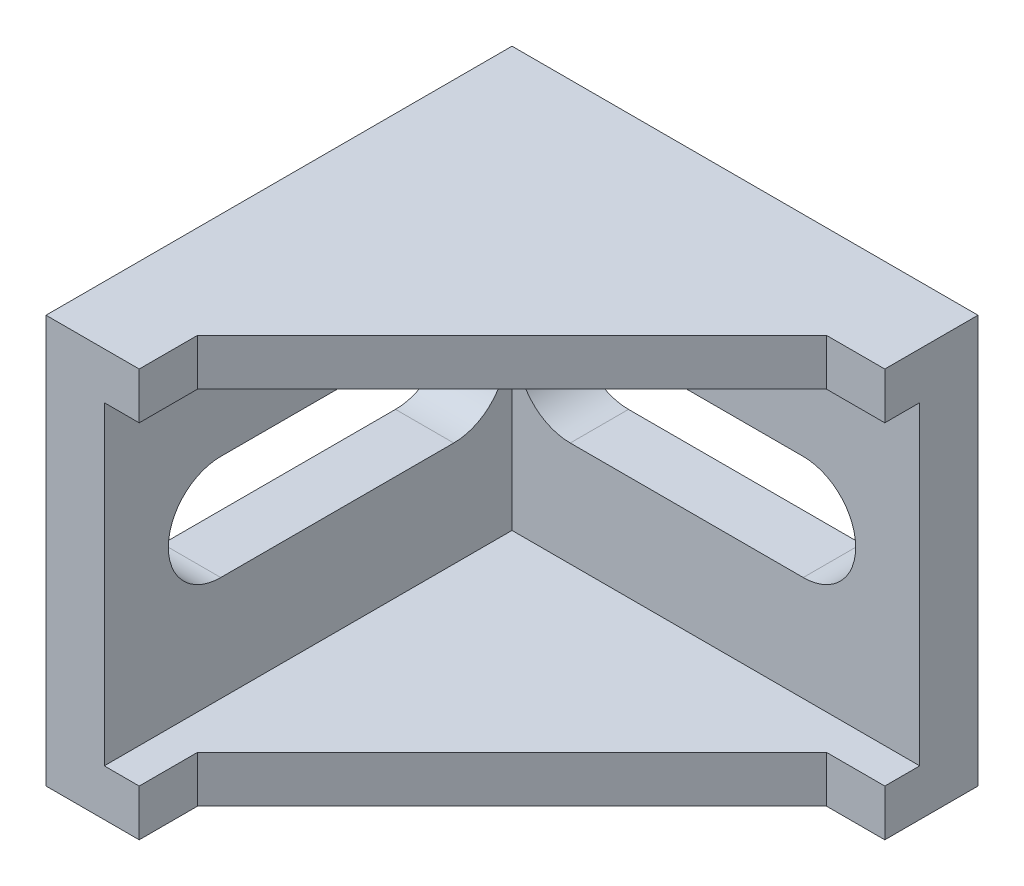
ISO-10303-21;
HEADER;
FILE_DESCRIPTION(('STEP AP214'),'2;1');
FILE_NAME('part.step','',(''),(''),'','','');
FILE_SCHEMA(('AUTOMOTIVE_DESIGN { 1 0 10303 214 1 1 1 1 }'));
ENDSEC;
DATA;
#1=APPLICATION_CONTEXT('core data for automotive mechanical design processes');
#2=APPLICATION_PROTOCOL_DEFINITION('international standard','automotive_design',2000,#1);
#3=PRODUCT_CONTEXT('',#1,'mechanical');
#4=PRODUCT('Part','Part','',(#3));
#5=PRODUCT_RELATED_PRODUCT_CATEGORY('part','',(#4));
#6=PRODUCT_DEFINITION_FORMATION('','',#4);
#7=PRODUCT_DEFINITION_CONTEXT('part definition',#1,'design');
#8=PRODUCT_DEFINITION('design','',#6,#7);
#9=PRODUCT_DEFINITION_SHAPE('','',#8);
#10=(LENGTH_UNIT() NAMED_UNIT(*) SI_UNIT(.MILLI.,.METRE.));
#11=(NAMED_UNIT(*) PLANE_ANGLE_UNIT() SI_UNIT($,.RADIAN.));
#12=(NAMED_UNIT(*) SI_UNIT($,.STERADIAN.) SOLID_ANGLE_UNIT());
#13=UNCERTAINTY_MEASURE_WITH_UNIT(LENGTH_MEASURE(1.E-05),#10,'distance_accuracy_value','');
#14=(GEOMETRIC_REPRESENTATION_CONTEXT(3) GLOBAL_UNCERTAINTY_ASSIGNED_CONTEXT((#13)) GLOBAL_UNIT_ASSIGNED_CONTEXT((#10,
#11,#12)) REPRESENTATION_CONTEXT('',''));
#15=CARTESIAN_POINT('',(0.,0.,0.));
#16=DIRECTION('',(0.,0.,1.));
#17=DIRECTION('',(1.,0.,0.));
#18=AXIS2_PLACEMENT_3D('',#15,#16,#17);
#19=CARTESIAN_POINT('',(0.,35.,0.));
#20=DIRECTION('',(1.,0.,0.));
#21=DIRECTION('',(0.,1.,0.));
#22=AXIS2_PLACEMENT_3D('',#19,#20,#21);
#23=PLANE('',#22);
#24=DIRECTION('',(0.,0.,1.));
#25=VECTOR('',#24,1.);
#26=CARTESIAN_POINT('',(0.,13.,0.));
#27=LINE('',#26,#25);
#28=CARTESIAN_POINT('',(0.,13.,-30.));
#29=VERTEX_POINT('',#28);
#30=CARTESIAN_POINT('',(0.,13.,-10.));
#31=VERTEX_POINT('',#30);
#32=EDGE_CURVE('E48',#29,#31,#27,.T.);
#33=ORIENTED_EDGE('',*,*,#32,.F.);
#34=CARTESIAN_POINT('',(0.,17.5,-30.));
#35=DIRECTION('',(-1.,0.,0.));
#36=DIRECTION('',(0.,1.,0.));
#37=AXIS2_PLACEMENT_3D('',#34,#35,#36);
#38=CIRCLE('',#37,4.5);
#39=CARTESIAN_POINT('',(0.,22.,-30.));
#40=VERTEX_POINT('',#39);
#41=EDGE_CURVE('E114',#40,#29,#38,.T.);
#42=ORIENTED_EDGE('',*,*,#41,.F.);
#43=DIRECTION('',(0.,0.,-1.));
#44=VECTOR('',#43,1.);
#45=CARTESIAN_POINT('',(0.,22.,0.));
#46=LINE('',#45,#44);
#47=CARTESIAN_POINT('',(0.,22.,-10.));
#48=VERTEX_POINT('',#47);
#49=EDGE_CURVE('E109',#48,#40,#46,.T.);
#50=ORIENTED_EDGE('',*,*,#49,.F.);
#51=CARTESIAN_POINT('',(0.,17.5,-10.));
#52=DIRECTION('',(-1.,0.,0.));
#53=DIRECTION('',(0.,1.,0.));
#54=AXIS2_PLACEMENT_3D('',#51,#52,#53);
#55=CIRCLE('',#54,4.5);
#56=EDGE_CURVE('E11',#31,#48,#55,.T.);
#57=ORIENTED_EDGE('',*,*,#56,.F.);
#58=EDGE_LOOP('',(#33,#42,#50,#57));
#59=FACE_BOUND('',#58,.T.);
#60=DIRECTION('',(0.,0.,1.));
#61=VECTOR('',#60,1.);
#62=CARTESIAN_POINT('',(0.,35.,0.));
#63=LINE('',#62,#61);
#64=CARTESIAN_POINT('',(0.,35.,-40.));
#65=VERTEX_POINT('',#64);
#66=CARTESIAN_POINT('',(0.,35.,0.));
#67=VERTEX_POINT('',#66);
#68=EDGE_CURVE('E132',#65,#67,#63,.T.);
#69=ORIENTED_EDGE('',*,*,#68,.F.);
#70=DIRECTION('',(0.,1.,0.));
#71=VECTOR('',#70,1.);
#72=CARTESIAN_POINT('',(0.,35.,-40.));
#73=LINE('',#72,#71);
#74=CARTESIAN_POINT('',(0.,0.,-40.));
#75=VERTEX_POINT('',#74);
#76=EDGE_CURVE('E188',#75,#65,#73,.T.);
#77=ORIENTED_EDGE('',*,*,#76,.F.);
#78=DIRECTION('',(0.,0.,-1.));
#79=VECTOR('',#78,1.);
#80=CARTESIAN_POINT('',(0.,0.,0.));
#81=LINE('',#80,#79);
#82=CARTESIAN_POINT('',(0.,0.,0.));
#83=VERTEX_POINT('',#82);
#84=EDGE_CURVE('E179',#83,#75,#81,.T.);
#85=ORIENTED_EDGE('',*,*,#84,.F.);
#86=DIRECTION('',(0.,-1.,0.));
#87=VECTOR('',#86,1.);
#88=CARTESIAN_POINT('',(0.,35.,0.));
#89=LINE('',#88,#87);
#90=EDGE_CURVE('E121',#67,#83,#89,.T.);
#91=ORIENTED_EDGE('',*,*,#90,.F.);
#92=EDGE_LOOP('',(#69,#77,#85,#91));
#93=FACE_BOUND('',#92,.T.);
#94=ADVANCED_FACE('F17',(#59,#93),#23,.F.);
#95=CARTESIAN_POINT('',(-30.,17.5,-10.));
#96=DIRECTION('',(1.,0.,0.));
#97=DIRECTION('',(0.,1.,0.));
#98=AXIS2_PLACEMENT_3D('',#95,#96,#97);
#99=CYLINDRICAL_SURFACE('',#98,4.5);
#100=DIRECTION('',(1.,0.,0.));
#101=VECTOR('',#100,1.);
#102=CARTESIAN_POINT('',(-30.,13.,-10.));
#103=LINE('',#102,#101);
#104=CARTESIAN_POINT('',(5.,13.,-10.));
#105=VERTEX_POINT('',#104);
#106=EDGE_CURVE('E27',#31,#105,#103,.T.);
#107=ORIENTED_EDGE('',*,*,#106,.F.);
#108=ORIENTED_EDGE('',*,*,#56,.T.);
#109=DIRECTION('',(-1.,0.,0.));
#110=VECTOR('',#109,1.);
#111=CARTESIAN_POINT('',(-30.,22.,-10.));
#112=LINE('',#111,#110);
#113=CARTESIAN_POINT('',(5.,22.,-10.));
#114=VERTEX_POINT('',#113);
#115=EDGE_CURVE('E106',#114,#48,#112,.T.);
#116=ORIENTED_EDGE('',*,*,#115,.F.);
#117=CARTESIAN_POINT('',(5.,17.5,-10.));
#118=DIRECTION('',(-1.,0.,0.));
#119=DIRECTION('',(0.,1.,0.));
#120=AXIS2_PLACEMENT_3D('',#117,#118,#119);
#121=CIRCLE('',#120,4.5);
#122=EDGE_CURVE('E154',#105,#114,#121,.T.);
#123=ORIENTED_EDGE('',*,*,#122,.F.);
#124=EDGE_LOOP('',(#107,#108,#116,#123));
#125=FACE_BOUND('',#124,.T.);
#126=ADVANCED_FACE('F19',(#125),#99,.F.);
#127=CARTESIAN_POINT('',(-30.,13.,-10.));
#128=DIRECTION('',(0.,-1.,0.));
#129=DIRECTION('',(0.,0.,-1.));
#130=AXIS2_PLACEMENT_3D('',#127,#128,#129);
#131=PLANE('',#130);
#132=DIRECTION('',(1.,0.,0.));
#133=VECTOR('',#132,1.);
#134=CARTESIAN_POINT('',(-30.,13.,-30.));
#135=LINE('',#134,#133);
#136=CARTESIAN_POINT('',(5.,13.,-30.));
#137=VERTEX_POINT('',#136);
#138=EDGE_CURVE('E138',#29,#137,#135,.T.);
#139=ORIENTED_EDGE('',*,*,#138,.F.);
#140=ORIENTED_EDGE('',*,*,#32,.T.);
#141=ORIENTED_EDGE('',*,*,#106,.T.);
#142=DIRECTION('',(0.,0.,1.));
#143=VECTOR('',#142,1.);
#144=CARTESIAN_POINT('',(5.,13.,-10.));
#145=LINE('',#144,#143);
#146=EDGE_CURVE('E151',#137,#105,#145,.T.);
#147=ORIENTED_EDGE('',*,*,#146,.F.);
#148=EDGE_LOOP('',(#139,#140,#141,#147));
#149=FACE_BOUND('',#148,.T.);
#150=ADVANCED_FACE('F149',(#149),#131,.F.);
#151=CARTESIAN_POINT('',(-30.,17.5,-30.));
#152=DIRECTION('',(1.,0.,0.));
#153=DIRECTION('',(0.,1.,0.));
#154=AXIS2_PLACEMENT_3D('',#151,#152,#153);
#155=CYLINDRICAL_SURFACE('',#154,4.5);
#156=DIRECTION('',(1.,0.,0.));
#157=VECTOR('',#156,1.);
#158=CARTESIAN_POINT('',(-30.,22.,-30.));
#159=LINE('',#158,#157);
#160=CARTESIAN_POINT('',(5.,22.,-30.));
#161=VERTEX_POINT('',#160);
#162=EDGE_CURVE('E117',#40,#161,#159,.T.);
#163=ORIENTED_EDGE('',*,*,#162,.F.);
#164=ORIENTED_EDGE('',*,*,#41,.T.);
#165=ORIENTED_EDGE('',*,*,#138,.T.);
#166=CARTESIAN_POINT('',(5.,17.5,-30.));
#167=DIRECTION('',(-1.,0.,0.));
#168=DIRECTION('',(0.,1.,0.));
#169=AXIS2_PLACEMENT_3D('',#166,#167,#168);
#170=CIRCLE('',#169,4.5);
#171=EDGE_CURVE('E162',#161,#137,#170,.T.);
#172=ORIENTED_EDGE('',*,*,#171,.F.);
#173=EDGE_LOOP('',(#163,#164,#165,#172));
#174=FACE_BOUND('',#173,.T.);
#175=ADVANCED_FACE('F824',(#174),#155,.F.);
#176=CARTESIAN_POINT('',(-30.,22.,-10.));
#177=DIRECTION('',(0.,1.,0.));
#178=DIRECTION('',(1.,0.,0.));
#179=AXIS2_PLACEMENT_3D('',#176,#177,#178);
#180=PLANE('',#179);
#181=ORIENTED_EDGE('',*,*,#115,.T.);
#182=ORIENTED_EDGE('',*,*,#49,.T.);
#183=ORIENTED_EDGE('',*,*,#162,.T.);
#184=DIRECTION('',(0.,0.,-1.));
#185=VECTOR('',#184,1.);
#186=CARTESIAN_POINT('',(5.,22.,-10.));
#187=LINE('',#186,#185);
#188=EDGE_CURVE('E125',#114,#161,#187,.T.);
#189=ORIENTED_EDGE('',*,*,#188,.F.);
#190=EDGE_LOOP('',(#181,#182,#183,#189));
#191=FACE_BOUND('',#190,.T.);
#192=ADVANCED_FACE('F120',(#191),#180,.F.);
#193=CARTESIAN_POINT('',(0.,35.,0.));
#194=DIRECTION('',(0.,0.,-1.));
#195=DIRECTION('',(0.,-1.,0.));
#196=AXIS2_PLACEMENT_3D('',#193,#194,#195);
#197=PLANE('',#196);
#198=DIRECTION('',(0.,-1.,0.));
#199=VECTOR('',#198,1.);
#200=CARTESIAN_POINT('',(8.,35.,0.));
#201=LINE('',#200,#199);
#202=CARTESIAN_POINT('',(8.,35.,0.));
#203=VERTEX_POINT('',#202);
#204=CARTESIAN_POINT('',(8.,31.,0.));
#205=VERTEX_POINT('',#204);
#206=EDGE_CURVE('E306',#203,#205,#201,.T.);
#207=ORIENTED_EDGE('',*,*,#206,.F.);
#208=DIRECTION('',(1.,0.,0.));
#209=VECTOR('',#208,1.);
#210=CARTESIAN_POINT('',(0.,35.,0.));
#211=LINE('',#210,#209);
#212=EDGE_CURVE('E129',#67,#203,#211,.T.);
#213=ORIENTED_EDGE('',*,*,#212,.F.);
#214=ORIENTED_EDGE('',*,*,#90,.T.);
#215=DIRECTION('',(-1.,0.,0.));
#216=VECTOR('',#215,1.);
#217=CARTESIAN_POINT('',(0.,0.,0.));
#218=LINE('',#217,#216);
#219=CARTESIAN_POINT('',(8.,0.,0.));
#220=VERTEX_POINT('',#219);
#221=EDGE_CURVE('E158',#220,#83,#218,.T.);
#222=ORIENTED_EDGE('',*,*,#221,.F.);
#223=DIRECTION('',(0.,-1.,0.));
#224=VECTOR('',#223,1.);
#225=CARTESIAN_POINT('',(8.,35.,0.));
#226=LINE('',#225,#224);
#227=CARTESIAN_POINT('',(8.,4.,0.));
#228=VERTEX_POINT('',#227);
#229=EDGE_CURVE('E294',#228,#220,#226,.T.);
#230=ORIENTED_EDGE('',*,*,#229,.F.);
#231=DIRECTION('',(1.,0.,0.));
#232=VECTOR('',#231,1.);
#233=CARTESIAN_POINT('',(0.,4.,0.));
#234=LINE('',#233,#232);
#235=CARTESIAN_POINT('',(5.,4.,0.));
#236=VERTEX_POINT('',#235);
#237=EDGE_CURVE('E290',#236,#228,#234,.T.);
#238=ORIENTED_EDGE('',*,*,#237,.F.);
#239=DIRECTION('',(0.,-1.,0.));
#240=VECTOR('',#239,1.);
#241=CARTESIAN_POINT('',(5.,35.,0.));
#242=LINE('',#241,#240);
#243=CARTESIAN_POINT('',(5.,31.,0.));
#244=VERTEX_POINT('',#243);
#245=EDGE_CURVE('E172',#244,#236,#242,.T.);
#246=ORIENTED_EDGE('',*,*,#245,.F.);
#247=DIRECTION('',(-1.,0.,0.));
#248=VECTOR('',#247,1.);
#249=CARTESIAN_POINT('',(0.,31.,0.));
#250=LINE('',#249,#248);
#251=EDGE_CURVE('E320',#205,#244,#250,.T.);
#252=ORIENTED_EDGE('',*,*,#251,.F.);
#253=EDGE_LOOP('',(#207,#213,#214,#222,#230,#238,#246,#252));
#254=FACE_BOUND('',#253,.T.);
#255=ADVANCED_FACE('F340',(#254),#197,.F.);
#256=CARTESIAN_POINT('',(0.,35.,0.));
#257=DIRECTION('',(0.,-1.,0.));
#258=DIRECTION('',(0.,0.,-1.));
#259=AXIS2_PLACEMENT_3D('',#256,#257,#258);
#260=PLANE('',#259);
#261=DIRECTION('',(0.,0.,1.));
#262=VECTOR('',#261,1.);
#263=CARTESIAN_POINT('',(8.,35.,0.));
#264=LINE('',#263,#262);
#265=CARTESIAN_POINT('',(8.,35.,-5.));
#266=VERTEX_POINT('',#265);
#267=EDGE_CURVE('E303',#266,#203,#264,.T.);
#268=ORIENTED_EDGE('',*,*,#267,.F.);
#269=DIRECTION('',(-0.707106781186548,0.,0.707106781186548));
#270=VECTOR('',#269,1.);
#271=CARTESIAN_POINT('',(35.,35.,-32.));
#272=LINE('',#271,#270);
#273=CARTESIAN_POINT('',(35.,35.,-32.));
#274=VERTEX_POINT('',#273);
#275=EDGE_CURVE('E273',#274,#266,#272,.T.);
#276=ORIENTED_EDGE('',*,*,#275,.F.);
#277=DIRECTION('',(-1.,0.,0.));
#278=VECTOR('',#277,1.);
#279=CARTESIAN_POINT('',(0.,35.,-32.));
#280=LINE('',#279,#278);
#281=CARTESIAN_POINT('',(40.,35.,-32.));
#282=VERTEX_POINT('',#281);
#283=EDGE_CURVE('E264',#282,#274,#280,.T.);
#284=ORIENTED_EDGE('',*,*,#283,.F.);
#285=DIRECTION('',(0.,0.,1.));
#286=VECTOR('',#285,1.);
#287=CARTESIAN_POINT('',(40.,35.,0.));
#288=LINE('',#287,#286);
#289=CARTESIAN_POINT('',(40.,35.,-40.));
#290=VERTEX_POINT('',#289);
#291=EDGE_CURVE('E251',#290,#282,#288,.T.);
#292=ORIENTED_EDGE('',*,*,#291,.F.);
#293=DIRECTION('',(1.,0.,0.));
#294=VECTOR('',#293,1.);
#295=CARTESIAN_POINT('',(0.,35.,-40.));
#296=LINE('',#295,#294);
#297=EDGE_CURVE('E186',#65,#290,#296,.T.);
#298=ORIENTED_EDGE('',*,*,#297,.F.);
#299=ORIENTED_EDGE('',*,*,#68,.T.);
#300=ORIENTED_EDGE('',*,*,#212,.T.);
#301=EDGE_LOOP('',(#268,#276,#284,#292,#298,#299,#300));
#302=FACE_BOUND('',#301,.T.);
#303=ADVANCED_FACE('F858',(#302),#260,.F.);
#304=CARTESIAN_POINT('',(0.,35.,-40.));
#305=DIRECTION('',(0.,0.,1.));
#306=DIRECTION('',(1.,0.,0.));
#307=AXIS2_PLACEMENT_3D('',#304,#305,#306);
#308=PLANE('',#307);
#309=DIRECTION('',(-1.,0.,0.));
#310=VECTOR('',#309,1.);
#311=CARTESIAN_POINT('',(0.,13.,-40.));
#312=LINE('',#311,#310);
#313=CARTESIAN_POINT('',(30.,13.,-40.));
#314=VERTEX_POINT('',#313);
#315=CARTESIAN_POINT('',(10.,13.,-40.));
#316=VERTEX_POINT('',#315);
#317=EDGE_CURVE('E235',#314,#316,#312,.T.);
#318=ORIENTED_EDGE('',*,*,#317,.F.);
#319=CARTESIAN_POINT('',(30.,17.5,-40.));
#320=DIRECTION('',(0.,0.,-1.));
#321=DIRECTION('',(1.,0.,0.));
#322=AXIS2_PLACEMENT_3D('',#319,#320,#321);
#323=CIRCLE('',#322,4.5);
#324=CARTESIAN_POINT('',(34.5,17.5,-40.));
#325=VERTEX_POINT('',#324);
#326=EDGE_CURVE('E221',#325,#314,#323,.T.);
#327=ORIENTED_EDGE('',*,*,#326,.F.);
#328=CARTESIAN_POINT('',(30.,17.5,-40.));
#329=DIRECTION('',(0.,0.,-1.));
#330=DIRECTION('',(1.,0.,0.));
#331=AXIS2_PLACEMENT_3D('',#328,#329,#330);
#332=CIRCLE('',#331,4.5);
#333=CARTESIAN_POINT('',(30.,22.,-40.));
#334=VERTEX_POINT('',#333);
#335=EDGE_CURVE('E569',#334,#325,#332,.T.);
#336=ORIENTED_EDGE('',*,*,#335,.F.);
#337=DIRECTION('',(1.,0.,0.));
#338=VECTOR('',#337,1.);
#339=CARTESIAN_POINT('',(0.,22.,-40.));
#340=LINE('',#339,#338);
#341=CARTESIAN_POINT('',(10.,22.,-40.));
#342=VERTEX_POINT('',#341);
#343=EDGE_CURVE('E219',#342,#334,#340,.T.);
#344=ORIENTED_EDGE('',*,*,#343,.F.);
#345=CARTESIAN_POINT('',(10.,17.5,-40.));
#346=DIRECTION('',(0.,0.,-1.));
#347=DIRECTION('',(1.,0.,0.));
#348=AXIS2_PLACEMENT_3D('',#345,#346,#347);
#349=CIRCLE('',#348,4.5);
#350=EDGE_CURVE('E239',#316,#342,#349,.T.);
#351=ORIENTED_EDGE('',*,*,#350,.F.);
#352=EDGE_LOOP('',(#318,#327,#336,#344,#351));
#353=FACE_BOUND('',#352,.T.);
#354=ORIENTED_EDGE('',*,*,#297,.T.);
#355=DIRECTION('',(0.,1.,0.));
#356=VECTOR('',#355,1.);
#357=CARTESIAN_POINT('',(40.,35.,-40.));
#358=LINE('',#357,#356);
#359=CARTESIAN_POINT('',(40.,0.,-40.));
#360=VERTEX_POINT('',#359);
#361=EDGE_CURVE('E252',#360,#290,#358,.T.);
#362=ORIENTED_EDGE('',*,*,#361,.F.);
#363=DIRECTION('',(1.,0.,0.));
#364=VECTOR('',#363,1.);
#365=CARTESIAN_POINT('',(0.,0.,-40.));
#366=LINE('',#365,#364);
#367=EDGE_CURVE('E181',#75,#360,#366,.T.);
#368=ORIENTED_EDGE('',*,*,#367,.F.);
#369=ORIENTED_EDGE('',*,*,#76,.T.);
#370=EDGE_LOOP('',(#354,#362,#368,#369));
#371=FACE_BOUND('',#370,.T.);
#372=ADVANCED_FACE('F502',(#353,#371),#308,.F.);
#373=CARTESIAN_POINT('',(0.,0.,0.));
#374=DIRECTION('',(0.,-1.,0.));
#375=DIRECTION('',(0.,0.,-1.));
#376=AXIS2_PLACEMENT_3D('',#373,#374,#375);
#377=PLANE('',#376);
#378=DIRECTION('',(-1.,0.,0.));
#379=VECTOR('',#378,1.);
#380=CARTESIAN_POINT('',(0.,0.,-32.));
#381=LINE('',#380,#379);
#382=CARTESIAN_POINT('',(40.,0.,-32.));
#383=VERTEX_POINT('',#382);
#384=CARTESIAN_POINT('',(35.,0.,-32.));
#385=VERTEX_POINT('',#384);
#386=EDGE_CURVE('E381',#383,#385,#381,.T.);
#387=ORIENTED_EDGE('',*,*,#386,.T.);
#388=DIRECTION('',(-0.707106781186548,0.,0.707106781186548));
#389=VECTOR('',#388,1.);
#390=CARTESIAN_POINT('',(35.,0.,-32.));
#391=LINE('',#390,#389);
#392=CARTESIAN_POINT('',(8.,0.,-5.));
#393=VERTEX_POINT('',#392);
#394=EDGE_CURVE('E215',#385,#393,#391,.T.);
#395=ORIENTED_EDGE('',*,*,#394,.T.);
#396=DIRECTION('',(0.,0.,1.));
#397=VECTOR('',#396,1.);
#398=CARTESIAN_POINT('',(8.,0.,0.));
#399=LINE('',#398,#397);
#400=EDGE_CURVE('E298',#393,#220,#399,.T.);
#401=ORIENTED_EDGE('',*,*,#400,.T.);
#402=ORIENTED_EDGE('',*,*,#221,.T.);
#403=ORIENTED_EDGE('',*,*,#84,.T.);
#404=ORIENTED_EDGE('',*,*,#367,.T.);
#405=DIRECTION('',(0.,0.,1.));
#406=VECTOR('',#405,1.);
#407=CARTESIAN_POINT('',(40.,0.,0.));
#408=LINE('',#407,#406);
#409=EDGE_CURVE('E249',#360,#383,#408,.T.);
#410=ORIENTED_EDGE('',*,*,#409,.T.);
#411=EDGE_LOOP('',(#387,#395,#401,#402,#403,#404,#410));
#412=FACE_BOUND('',#411,.T.);
#413=ADVANCED_FACE('F405',(#412),#377,.T.);
#414=CARTESIAN_POINT('',(5.,31.,-35.));
#415=DIRECTION('',(-1.,0.,0.));
#416=DIRECTION('',(0.,1.,0.));
#417=AXIS2_PLACEMENT_3D('',#414,#415,#416);
#418=PLANE('',#417);
#419=ORIENTED_EDGE('',*,*,#188,.T.);
#420=ORIENTED_EDGE('',*,*,#171,.T.);
#421=ORIENTED_EDGE('',*,*,#146,.T.);
#422=ORIENTED_EDGE('',*,*,#122,.T.);
#423=EDGE_LOOP('',(#419,#420,#421,#422));
#424=FACE_BOUND('',#423,.T.);
#425=DIRECTION('',(0.,-1.,0.));
#426=VECTOR('',#425,1.);
#427=CARTESIAN_POINT('',(5.,31.,-35.));
#428=LINE('',#427,#426);
#429=CARTESIAN_POINT('',(5.,31.,-35.));
#430=VERTEX_POINT('',#429);
#431=CARTESIAN_POINT('',(5.,4.,-35.));
#432=VERTEX_POINT('',#431);
#433=EDGE_CURVE('E362',#430,#432,#428,.T.);
#434=ORIENTED_EDGE('',*,*,#433,.F.);
#435=DIRECTION('',(0.,0.,-1.));
#436=VECTOR('',#435,1.);
#437=CARTESIAN_POINT('',(5.,31.,-35.));
#438=LINE('',#437,#436);
#439=EDGE_CURVE('E319',#244,#430,#438,.T.);
#440=ORIENTED_EDGE('',*,*,#439,.F.);
#441=ORIENTED_EDGE('',*,*,#245,.T.);
#442=DIRECTION('',(0.,0.,1.));
#443=VECTOR('',#442,1.);
#444=CARTESIAN_POINT('',(5.,4.,-35.));
#445=LINE('',#444,#443);
#446=EDGE_CURVE('E287',#432,#236,#445,.T.);
#447=ORIENTED_EDGE('',*,*,#446,.F.);
#448=EDGE_LOOP('',(#434,#440,#441,#447));
#449=FACE_BOUND('',#448,.T.);
#450=ADVANCED_FACE('F159',(#424,#449),#418,.F.);
#451=CARTESIAN_POINT('',(5.,31.,-35.));
#452=DIRECTION('',(0.,1.,0.));
#453=DIRECTION('',(1.,0.,0.));
#454=AXIS2_PLACEMENT_3D('',#451,#452,#453);
#455=PLANE('',#454);
#456=DIRECTION('',(-1.,0.,0.));
#457=VECTOR('',#456,1.);
#458=CARTESIAN_POINT('',(5.,31.,-35.));
#459=LINE('',#458,#457);
#460=CARTESIAN_POINT('',(40.,31.,-35.));
#461=VERTEX_POINT('',#460);
#462=EDGE_CURVE('E356',#461,#430,#459,.T.);
#463=ORIENTED_EDGE('',*,*,#462,.F.);
#464=DIRECTION('',(0.,0.,-1.));
#465=VECTOR('',#464,1.);
#466=CARTESIAN_POINT('',(40.,31.,-35.));
#467=LINE('',#466,#465);
#468=CARTESIAN_POINT('',(40.,31.,-32.));
#469=VERTEX_POINT('',#468);
#470=EDGE_CURVE('E261',#469,#461,#467,.T.);
#471=ORIENTED_EDGE('',*,*,#470,.F.);
#472=DIRECTION('',(1.,0.,0.));
#473=VECTOR('',#472,1.);
#474=CARTESIAN_POINT('',(5.,31.,-32.));
#475=LINE('',#474,#473);
#476=CARTESIAN_POINT('',(35.,31.,-32.));
#477=VERTEX_POINT('',#476);
#478=EDGE_CURVE('E272',#477,#469,#475,.T.);
#479=ORIENTED_EDGE('',*,*,#478,.F.);
#480=DIRECTION('',(0.707106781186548,0.,-0.707106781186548));
#481=VECTOR('',#480,1.);
#482=CARTESIAN_POINT('',(8.,31.,-5.));
#483=LINE('',#482,#481);
#484=CARTESIAN_POINT('',(8.,31.,-5.));
#485=VERTEX_POINT('',#484);
#486=EDGE_CURVE('E282',#485,#477,#483,.T.);
#487=ORIENTED_EDGE('',*,*,#486,.F.);
#488=DIRECTION('',(0.,0.,-1.));
#489=VECTOR('',#488,1.);
#490=CARTESIAN_POINT('',(8.,31.,-35.));
#491=LINE('',#490,#489);
#492=EDGE_CURVE('E311',#205,#485,#491,.T.);
#493=ORIENTED_EDGE('',*,*,#492,.F.);
#494=ORIENTED_EDGE('',*,*,#251,.T.);
#495=ORIENTED_EDGE('',*,*,#439,.T.);
#496=EDGE_LOOP('',(#463,#471,#479,#487,#493,#494,#495));
#497=FACE_BOUND('',#496,.T.);
#498=ADVANCED_FACE('F542',(#497),#455,.F.);
#499=CARTESIAN_POINT('',(8.,35.,0.));
#500=DIRECTION('',(-1.,0.,0.));
#501=DIRECTION('',(0.,0.,1.));
#502=AXIS2_PLACEMENT_3D('',#499,#500,#501);
#503=PLANE('',#502);
#504=DIRECTION('',(0.,-1.,0.));
#505=VECTOR('',#504,1.);
#506=CARTESIAN_POINT('',(8.,35.,-5.));
#507=LINE('',#506,#505);
#508=EDGE_CURVE('E279',#266,#485,#507,.T.);
#509=ORIENTED_EDGE('',*,*,#508,.F.);
#510=ORIENTED_EDGE('',*,*,#267,.T.);
#511=ORIENTED_EDGE('',*,*,#206,.T.);
#512=ORIENTED_EDGE('',*,*,#492,.T.);
#513=EDGE_LOOP('',(#509,#510,#511,#512));
#514=FACE_BOUND('',#513,.T.);
#515=ADVANCED_FACE('F903',(#514),#503,.F.);
#516=CARTESIAN_POINT('',(8.,35.,0.));
#517=DIRECTION('',(-1.,0.,0.));
#518=DIRECTION('',(0.,0.,1.));
#519=AXIS2_PLACEMENT_3D('',#516,#517,#518);
#520=PLANE('',#519);
#521=ORIENTED_EDGE('',*,*,#229,.T.);
#522=ORIENTED_EDGE('',*,*,#400,.F.);
#523=DIRECTION('',(0.,-1.,0.));
#524=VECTOR('',#523,1.);
#525=CARTESIAN_POINT('',(8.,35.,-5.));
#526=LINE('',#525,#524);
#527=CARTESIAN_POINT('',(8.,4.,-5.));
#528=VERTEX_POINT('',#527);
#529=EDGE_CURVE('E374',#528,#393,#526,.T.);
#530=ORIENTED_EDGE('',*,*,#529,.F.);
#531=DIRECTION('',(0.,0.,-1.));
#532=VECTOR('',#531,1.);
#533=CARTESIAN_POINT('',(8.,4.,0.));
#534=LINE('',#533,#532);
#535=EDGE_CURVE('E295',#228,#528,#534,.T.);
#536=ORIENTED_EDGE('',*,*,#535,.F.);
#537=EDGE_LOOP('',(#521,#522,#530,#536));
#538=FACE_BOUND('',#537,.T.);
#539=ADVANCED_FACE('F906',(#538),#520,.F.);
#540=CARTESIAN_POINT('',(5.,4.,-35.));
#541=DIRECTION('',(0.,-1.,0.));
#542=DIRECTION('',(0.,0.,-1.));
#543=AXIS2_PLACEMENT_3D('',#540,#541,#542);
#544=PLANE('',#543);
#545=DIRECTION('',(0.,0.,1.));
#546=VECTOR('',#545,1.);
#547=CARTESIAN_POINT('',(40.,4.,-35.));
#548=LINE('',#547,#546);
#549=CARTESIAN_POINT('',(40.,4.,-35.));
#550=VERTEX_POINT('',#549);
#551=CARTESIAN_POINT('',(40.,4.,-32.));
#552=VERTEX_POINT('',#551);
#553=EDGE_CURVE('E243',#550,#552,#548,.T.);
#554=ORIENTED_EDGE('',*,*,#553,.F.);
#555=DIRECTION('',(1.,0.,0.));
#556=VECTOR('',#555,1.);
#557=CARTESIAN_POINT('',(5.,4.,-35.));
#558=LINE('',#557,#556);
#559=EDGE_CURVE('E346',#432,#550,#558,.T.);
#560=ORIENTED_EDGE('',*,*,#559,.F.);
#561=ORIENTED_EDGE('',*,*,#446,.T.);
#562=ORIENTED_EDGE('',*,*,#237,.T.);
#563=ORIENTED_EDGE('',*,*,#535,.T.);
#564=DIRECTION('',(-0.707106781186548,0.,0.707106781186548));
#565=VECTOR('',#564,1.);
#566=CARTESIAN_POINT('',(35.,4.,-32.));
#567=LINE('',#566,#565);
#568=CARTESIAN_POINT('',(35.,4.,-32.));
#569=VERTEX_POINT('',#568);
#570=EDGE_CURVE('E213',#569,#528,#567,.T.);
#571=ORIENTED_EDGE('',*,*,#570,.F.);
#572=DIRECTION('',(-1.,0.,0.));
#573=VECTOR('',#572,1.);
#574=CARTESIAN_POINT('',(5.,4.,-32.));
#575=LINE('',#574,#573);
#576=EDGE_CURVE('E371',#552,#569,#575,.T.);
#577=ORIENTED_EDGE('',*,*,#576,.F.);
#578=EDGE_LOOP('',(#554,#560,#561,#562,#563,#571,#577));
#579=FACE_BOUND('',#578,.T.);
#580=ADVANCED_FACE('F343',(#579),#544,.F.);
#581=CARTESIAN_POINT('',(8.,35.,-5.));
#582=DIRECTION('',(-0.707106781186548,0.,-0.707106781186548));
#583=DIRECTION('',(-0.707106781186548,0.,0.707106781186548));
#584=AXIS2_PLACEMENT_3D('',#581,#582,#583);
#585=PLANE('',#584);
#586=DIRECTION('',(0.,-1.,0.));
#587=VECTOR('',#586,1.);
#588=CARTESIAN_POINT('',(35.,35.,-32.));
#589=LINE('',#588,#587);
#590=EDGE_CURVE('E267',#274,#477,#589,.T.);
#591=ORIENTED_EDGE('',*,*,#590,.F.);
#592=ORIENTED_EDGE('',*,*,#275,.T.);
#593=ORIENTED_EDGE('',*,*,#508,.T.);
#594=ORIENTED_EDGE('',*,*,#486,.T.);
#595=EDGE_LOOP('',(#591,#592,#593,#594));
#596=FACE_BOUND('',#595,.T.);
#597=ADVANCED_FACE('F921',(#596),#585,.F.);
#598=CARTESIAN_POINT('',(35.,35.,-32.));
#599=DIRECTION('',(0.,0.,-1.));
#600=DIRECTION('',(0.,-1.,0.));
#601=AXIS2_PLACEMENT_3D('',#598,#599,#600);
#602=PLANE('',#601);
#603=DIRECTION('',(0.,-1.,0.));
#604=VECTOR('',#603,1.);
#605=CARTESIAN_POINT('',(40.,35.,-32.));
#606=LINE('',#605,#604);
#607=EDGE_CURVE('E260',#282,#469,#606,.T.);
#608=ORIENTED_EDGE('',*,*,#607,.F.);
#609=ORIENTED_EDGE('',*,*,#283,.T.);
#610=ORIENTED_EDGE('',*,*,#590,.T.);
#611=ORIENTED_EDGE('',*,*,#478,.T.);
#612=EDGE_LOOP('',(#608,#609,#610,#611));
#613=FACE_BOUND('',#612,.T.);
#614=ADVANCED_FACE('F615',(#613),#602,.F.);
#615=CARTESIAN_POINT('',(40.,35.,-32.));
#616=DIRECTION('',(-1.,0.,0.));
#617=DIRECTION('',(0.,0.,1.));
#618=AXIS2_PLACEMENT_3D('',#615,#616,#617);
#619=PLANE('',#618);
#620=DIRECTION('',(0.,1.,0.));
#621=VECTOR('',#620,1.);
#622=CARTESIAN_POINT('',(40.,35.,-35.));
#623=LINE('',#622,#621);
#624=EDGE_CURVE('E361',#550,#461,#623,.T.);
#625=ORIENTED_EDGE('',*,*,#624,.F.);
#626=ORIENTED_EDGE('',*,*,#553,.T.);
#627=DIRECTION('',(0.,1.,0.));
#628=VECTOR('',#627,1.);
#629=CARTESIAN_POINT('',(40.,35.,-32.));
#630=LINE('',#629,#628);
#631=EDGE_CURVE('E376',#383,#552,#630,.T.);
#632=ORIENTED_EDGE('',*,*,#631,.F.);
#633=ORIENTED_EDGE('',*,*,#409,.F.);
#634=ORIENTED_EDGE('',*,*,#361,.T.);
#635=ORIENTED_EDGE('',*,*,#291,.T.);
#636=ORIENTED_EDGE('',*,*,#607,.T.);
#637=ORIENTED_EDGE('',*,*,#470,.T.);
#638=EDGE_LOOP('',(#625,#626,#632,#633,#634,#635,#636,#637));
#639=FACE_BOUND('',#638,.T.);
#640=ADVANCED_FACE('F515',(#639),#619,.F.);
#641=CARTESIAN_POINT('',(10.,17.5,-70.));
#642=DIRECTION('',(0.,0.,1.));
#643=DIRECTION('',(1.,0.,0.));
#644=AXIS2_PLACEMENT_3D('',#641,#642,#643);
#645=CYLINDRICAL_SURFACE('',#644,4.5);
#646=DIRECTION('',(0.,0.,1.));
#647=VECTOR('',#646,1.);
#648=CARTESIAN_POINT('',(10.,13.,-70.));
#649=LINE('',#648,#647);
#650=CARTESIAN_POINT('',(10.,13.,-35.));
#651=VERTEX_POINT('',#650);
#652=EDGE_CURVE('E240',#316,#651,#649,.T.);
#653=ORIENTED_EDGE('',*,*,#652,.F.);
#654=ORIENTED_EDGE('',*,*,#350,.T.);
#655=DIRECTION('',(0.,0.,-1.));
#656=VECTOR('',#655,1.);
#657=CARTESIAN_POINT('',(10.,22.,-70.));
#658=LINE('',#657,#656);
#659=CARTESIAN_POINT('',(10.,22.,-35.));
#660=VERTEX_POINT('',#659);
#661=EDGE_CURVE('E216',#660,#342,#658,.T.);
#662=ORIENTED_EDGE('',*,*,#661,.F.);
#663=CARTESIAN_POINT('',(10.,17.5,-35.));
#664=DIRECTION('',(0.,0.,-1.));
#665=DIRECTION('',(1.,0.,0.));
#666=AXIS2_PLACEMENT_3D('',#663,#664,#665);
#667=CIRCLE('',#666,4.5);
#668=EDGE_CURVE('E368',#651,#660,#667,.T.);
#669=ORIENTED_EDGE('',*,*,#668,.F.);
#670=EDGE_LOOP('',(#653,#654,#662,#669));
#671=FACE_BOUND('',#670,.T.);
#672=ADVANCED_FACE('F594',(#671),#645,.F.);
#673=CARTESIAN_POINT('',(10.,13.,-70.));
#674=DIRECTION('',(0.,-1.,0.));
#675=DIRECTION('',(0.,0.,-1.));
#676=AXIS2_PLACEMENT_3D('',#673,#674,#675);
#677=PLANE('',#676);
#678=DIRECTION('',(0.,0.,1.));
#679=VECTOR('',#678,1.);
#680=CARTESIAN_POINT('',(30.,13.,-70.));
#681=LINE('',#680,#679);
#682=CARTESIAN_POINT('',(30.,13.,-35.));
#683=VERTEX_POINT('',#682);
#684=EDGE_CURVE('E229',#314,#683,#681,.T.);
#685=ORIENTED_EDGE('',*,*,#684,.F.);
#686=ORIENTED_EDGE('',*,*,#317,.T.);
#687=ORIENTED_EDGE('',*,*,#652,.T.);
#688=DIRECTION('',(-1.,0.,0.));
#689=VECTOR('',#688,1.);
#690=CARTESIAN_POINT('',(10.,13.,-35.));
#691=LINE('',#690,#689);
#692=EDGE_CURVE('E385',#683,#651,#691,.T.);
#693=ORIENTED_EDGE('',*,*,#692,.F.);
#694=EDGE_LOOP('',(#685,#686,#687,#693));
#695=FACE_BOUND('',#694,.T.);
#696=ADVANCED_FACE('F593',(#695),#677,.F.);
#697=CARTESIAN_POINT('',(30.,17.5,-70.));
#698=DIRECTION('',(0.,0.,1.));
#699=DIRECTION('',(1.,0.,0.));
#700=AXIS2_PLACEMENT_3D('',#697,#698,#699);
#701=CYLINDRICAL_SURFACE('',#700,4.5);
#702=DIRECTION('',(0.,0.,1.));
#703=VECTOR('',#702,1.);
#704=CARTESIAN_POINT('',(34.5,17.5,-70.));
#705=LINE('',#704,#703);
#706=CARTESIAN_POINT('',(34.5,17.5,-35.));
#707=VERTEX_POINT('',#706);
#708=EDGE_CURVE('E572',#325,#707,#705,.T.);
#709=ORIENTED_EDGE('',*,*,#708,.F.);
#710=ORIENTED_EDGE('',*,*,#326,.T.);
#711=ORIENTED_EDGE('',*,*,#684,.T.);
#712=CARTESIAN_POINT('',(30.,17.5,-35.));
#713=DIRECTION('',(0.,0.,-1.));
#714=DIRECTION('',(1.,0.,0.));
#715=AXIS2_PLACEMENT_3D('',#712,#713,#714);
#716=CIRCLE('',#715,4.5);
#717=EDGE_CURVE('E360',#707,#683,#716,.T.);
#718=ORIENTED_EDGE('',*,*,#717,.F.);
#719=EDGE_LOOP('',(#709,#710,#711,#718));
#720=FACE_BOUND('',#719,.T.);
#721=ADVANCED_FACE('F591',(#720),#701,.F.);
#722=CARTESIAN_POINT('',(10.,22.,-70.));
#723=DIRECTION('',(0.,1.,0.));
#724=DIRECTION('',(1.,0.,0.));
#725=AXIS2_PLACEMENT_3D('',#722,#723,#724);
#726=PLANE('',#725);
#727=ORIENTED_EDGE('',*,*,#661,.T.);
#728=ORIENTED_EDGE('',*,*,#343,.T.);
#729=DIRECTION('',(0.,0.,1.));
#730=VECTOR('',#729,1.);
#731=CARTESIAN_POINT('',(30.,22.,-70.));
#732=LINE('',#731,#730);
#733=CARTESIAN_POINT('',(30.,22.,-35.));
#734=VERTEX_POINT('',#733);
#735=EDGE_CURVE('E547',#334,#734,#732,.T.);
#736=ORIENTED_EDGE('',*,*,#735,.T.);
#737=DIRECTION('',(1.,0.,0.));
#738=VECTOR('',#737,1.);
#739=CARTESIAN_POINT('',(10.,22.,-35.));
#740=LINE('',#739,#738);
#741=EDGE_CURVE('E367',#660,#734,#740,.T.);
#742=ORIENTED_EDGE('',*,*,#741,.F.);
#743=EDGE_LOOP('',(#727,#728,#736,#742));
#744=FACE_BOUND('',#743,.T.);
#745=ADVANCED_FACE('F605',(#744),#726,.F.);
#746=CARTESIAN_POINT('',(8.,35.,-5.));
#747=DIRECTION('',(-0.707106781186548,0.,-0.707106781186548));
#748=DIRECTION('',(-0.707106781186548,0.,0.707106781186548));
#749=AXIS2_PLACEMENT_3D('',#746,#747,#748);
#750=PLANE('',#749);
#751=ORIENTED_EDGE('',*,*,#529,.T.);
#752=ORIENTED_EDGE('',*,*,#394,.F.);
#753=DIRECTION('',(0.,-1.,0.));
#754=VECTOR('',#753,1.);
#755=CARTESIAN_POINT('',(35.,35.,-32.));
#756=LINE('',#755,#754);
#757=EDGE_CURVE('E380',#569,#385,#756,.T.);
#758=ORIENTED_EDGE('',*,*,#757,.F.);
#759=ORIENTED_EDGE('',*,*,#570,.T.);
#760=EDGE_LOOP('',(#751,#752,#758,#759));
#761=FACE_BOUND('',#760,.T.);
#762=ADVANCED_FACE('F409',(#761),#750,.F.);
#763=CARTESIAN_POINT('',(35.,35.,-32.));
#764=DIRECTION('',(0.,0.,-1.));
#765=DIRECTION('',(0.,-1.,0.));
#766=AXIS2_PLACEMENT_3D('',#763,#764,#765);
#767=PLANE('',#766);
#768=ORIENTED_EDGE('',*,*,#757,.T.);
#769=ORIENTED_EDGE('',*,*,#386,.F.);
#770=ORIENTED_EDGE('',*,*,#631,.T.);
#771=ORIENTED_EDGE('',*,*,#576,.T.);
#772=EDGE_LOOP('',(#768,#769,#770,#771));
#773=FACE_BOUND('',#772,.T.);
#774=ADVANCED_FACE('F512',(#773),#767,.F.);
#775=CARTESIAN_POINT('',(0.,0.,-35.));
#776=DIRECTION('',(0.,0.,1.));
#777=DIRECTION('',(1.,0.,0.));
#778=AXIS2_PLACEMENT_3D('',#775,#776,#777);
#779=PLANE('',#778);
#780=ORIENTED_EDGE('',*,*,#668,.T.);
#781=ORIENTED_EDGE('',*,*,#741,.T.);
#782=CARTESIAN_POINT('',(30.,17.5,-35.));
#783=DIRECTION('',(0.,0.,-1.));
#784=DIRECTION('',(1.,0.,0.));
#785=AXIS2_PLACEMENT_3D('',#782,#783,#784);
#786=CIRCLE('',#785,4.5);
#787=EDGE_CURVE('E553',#734,#707,#786,.T.);
#788=ORIENTED_EDGE('',*,*,#787,.T.);
#789=ORIENTED_EDGE('',*,*,#717,.T.);
#790=ORIENTED_EDGE('',*,*,#692,.T.);
#791=EDGE_LOOP('',(#780,#781,#788,#789,#790));
#792=FACE_BOUND('',#791,.T.);
#793=ORIENTED_EDGE('',*,*,#624,.T.);
#794=ORIENTED_EDGE('',*,*,#462,.T.);
#795=ORIENTED_EDGE('',*,*,#433,.T.);
#796=ORIENTED_EDGE('',*,*,#559,.T.);
#797=EDGE_LOOP('',(#793,#794,#795,#796));
#798=FACE_BOUND('',#797,.T.);
#799=ADVANCED_FACE('F546',(#792,#798),#779,.T.);
#800=CARTESIAN_POINT('',(30.,17.5,-70.));
#801=DIRECTION('',(0.,0.,1.));
#802=DIRECTION('',(1.,0.,0.));
#803=AXIS2_PLACEMENT_3D('',#800,#801,#802);
#804=CYLINDRICAL_SURFACE('',#803,4.5);
#805=ORIENTED_EDGE('',*,*,#335,.T.);
#806=ORIENTED_EDGE('',*,*,#708,.T.);
#807=ORIENTED_EDGE('',*,*,#787,.F.);
#808=ORIENTED_EDGE('',*,*,#735,.F.);
#809=EDGE_LOOP('',(#805,#806,#807,#808));
#810=FACE_BOUND('',#809,.T.);
#811=ADVANCED_FACE('F586',(#810),#804,.F.);
#812=CLOSED_SHELL('',(#94,#126,#150,#175,#192,#255,#303,#372,#413,#450,#498,#515,#539,#580,#597,
#614,#640,#672,#696,#721,#745,#762,#774,#799,#811));
#813=MANIFOLD_SOLID_BREP('B1',#812);
#814=ADVANCED_BREP_SHAPE_REPRESENTATION('',(#18,#813),#14);
#815=SHAPE_DEFINITION_REPRESENTATION(#9,#814);
ENDSEC;
END-ISO-10303-21;
